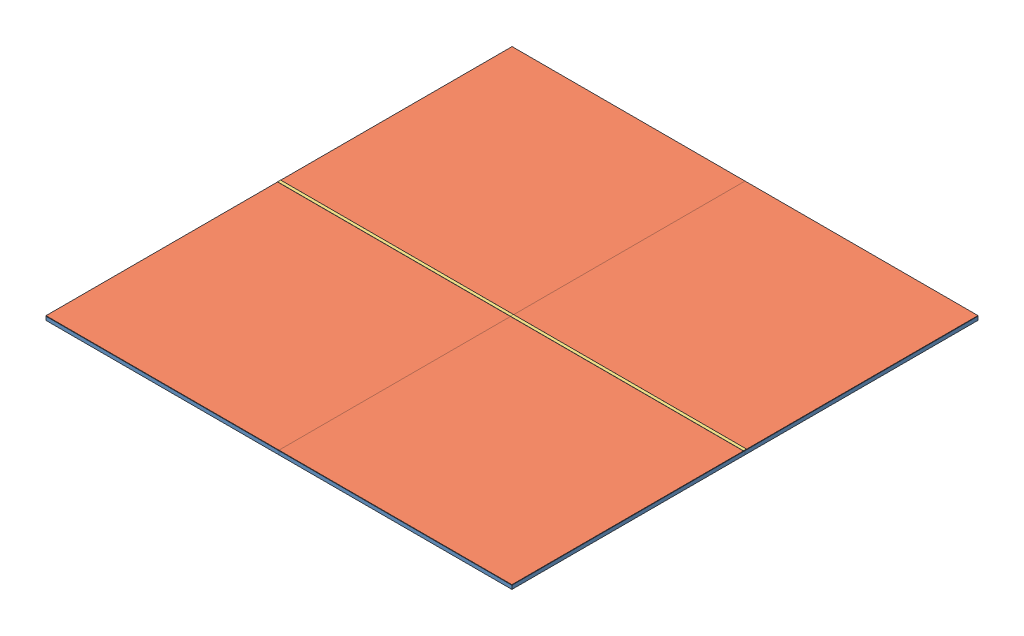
SolidWorks assembly Game Surface 2019.SLDASM, configuration Default (file format 9000). Lengths in mm.
Overall size (2438.4 22.92 2439.19).
11 component instances, 3 part files, 18 mates.
Components (placement in the parent):
- 4 4x4 Particle Board-1: 4 4x4 Particle Board.SLDASM [Default] at (1015.6726 496.0665 1023.1887) size (2438.4 19.05 2438.4)
  - Particle board-1: Particle board.SLDPRT [Default] at (-851.6262 679.1206 1589.7791) size (1219.2 19.05 1219.2)
  - Particle board-2: Particle board.SLDPRT [Default] at (367.5738 679.1206 1589.7791) size (1219.2 19.05 1219.2)
  - Particle board-3: Particle board.SLDPRT [Default] at (-851.6262 679.1206 370.5791) size (1219.2 19.05 1219.2)
  - Particle board-4: Particle board.SLDPRT [Default] at (367.5738 679.1206 370.5791) size (1219.2 19.05 1219.2)
- FRP-1: FRP.SLDPRT [Default] at (164.0464 1195.0542 2612.9678) size (1219.2 1.91 1219.2)
- FRP-2: FRP.SLDPRT [Default] at (164.0464 1195.0309 1392.9741) size (1219.2 1.91 1219.2)
- FRP-3: FRP.SLDPRT [Default] at (1383.2464 1195.0309 1392.9741) size (1219.2 1.91 1219.2)
- FRP-4: FRP.SLDPRT [Default] at (1383.2464 1195.0542 2612.9678) size (1219.2 1.91 1219.2)
- Surface connector-1: Surface connector.SLDPRT [Default] at (164.0464 1195.0309 2002.9709) size (1219.2 3.87 25.4)
- Surface connector-2: Surface connector.SLDPRT [Default] at (1383.2464 1195.0309 2002.9709) size (1219.2 3.87 25.4)
Mates (geometry in assembly coordinates):
- Coincident5: coincident anti-aligned: plane of FRP-3 through (773.6464 1195.0309 783.3741) normal (0 -1 0); plane of Surface connector-2 through (773.6464 1195.0309 1990.5249) normal (0 1 0)
- Coincident6: coincident anti-aligned: plane of FRP-3 through (773.6464 1196.9359 2002.5741) normal (0 0 1); plane of Surface connector-2 through (773.6464 1196.6417 2002.5741) normal (0 0 -1)
- Coincident7: coincident aligned: plane of FRP-3 through (1992.8464 1196.9359 2002.5741) normal (1 0 0); plane of Surface connector-2 through (1992.8464 1194.8002 2015.4169) normal (1 0 0)
- Coincident8: coincident anti-aligned: plane of FRP-2 through (-445.5536 1196.9359 2002.5741) normal (0 0 1); plane of Surface connector-1 through (-445.5536 1196.6417 2002.5741) normal (0 0 -1)
- Coincident9: coincident anti-aligned: plane of FRP-2 through (-445.5536 1195.0309 783.3741) normal (0 -1 0); plane of Surface connector-1 through (-445.5536 1195.0309 1990.5249) normal (0 1 0)
- Coincident10: coincident aligned: plane of FRP-2 through (773.6464 1196.9359 2002.5741) normal (1 0 0); plane of Surface connector-1 through (773.6464 1194.8002 2015.4169) normal (1 0 0)
- Coincident11: coincident anti-aligned: plane of FRP-2 through (773.6464 1196.9359 2002.5741) normal (1 0 0); plane of FRP-3 through (773.6464 1196.9359 2002.5741) normal (-1 0 0)
- Coincident12: coincident aligned: plane of FRP-2 through (-445.5536 1196.9359 783.3741) normal (0 1 0); plane of FRP-3 through (773.6464 1196.9359 783.3741) normal (0 1 0)
- Coincident13: coincident aligned: plane of FRP-2 through (-445.5536 1196.9359 783.3741) normal (0 0 -1); plane of FRP-3 through (773.6464 1196.9359 783.3741) normal (0 0 -1)
- Coincident14: coincident anti-aligned: plane of FRP-4 through (773.6464 1196.9592 2003.3678) normal (0 0 -1); plane of Surface connector-2 through (773.6464 1196.6417 2003.3678) normal (0 0 1)
- Coincident15: coincident anti-aligned: plane of FRP-4 through (773.6464 1195.0542 2003.3678) normal (0 -1 0); plane of Surface connector-2 through (773.6464 1195.0542 2003.3678) normal (0 1 0)
- Coincident16: coincident aligned: plane of FRP-4 through (1992.8464 1196.9592 3222.5678) normal (1 0 0); plane of Surface connector-2 through (1992.8464 1194.8002 2015.4169) normal (1 0 0)
- Coincident17: coincident anti-aligned: plane of FRP-1 through (773.6464 1196.9592 3222.5678) normal (1 0 0); plane of FRP-4 through (773.6464 1196.9592 3222.5678) normal (-1 0 0)
- Coincident18: coincident aligned: plane of FRP-1 through (-445.5536 1196.9592 2003.3678) normal (0 1 0); plane of FRP-4 through (773.6464 1196.9592 2003.3678) normal (0 1 0)
- Coincident19: coincident anti-aligned: plane of FRP-1 through (-445.5536 1196.9592 2003.3678) normal (0 0 -1); plane of Surface connector-1 through (-445.5536 1196.6417 2003.3678) normal (0 0 1)
- Coincident20: coincident anti-aligned: plane of 4 4x4 Particle Board-1/Particle board-3 through (-445.5536 1194.2371 784.1678) normal (0 1 0); plane of Surface connector-1 through (-445.5536 1194.2371 2015.4169) normal (0 -1 0)
- Coincident21: coincident aligned: plane of 4 4x4 Particle Board-1/Particle board-3 through (-445.5536 1194.2371 2003.3678) normal (-1 0 0); plane of Surface connector-1 through (-445.5536 1194.8002 2015.4169) normal (-1 0 0)
- Coincident22: coincident: plane of 4 4x4 Particle Board-1/Particle board-1 through (-445.5536 1194.2371 3222.5678) normal (0 0 1); line of FRP-1 through (-445.5536 1196.9592 3222.5678) axis (1 0 0)
